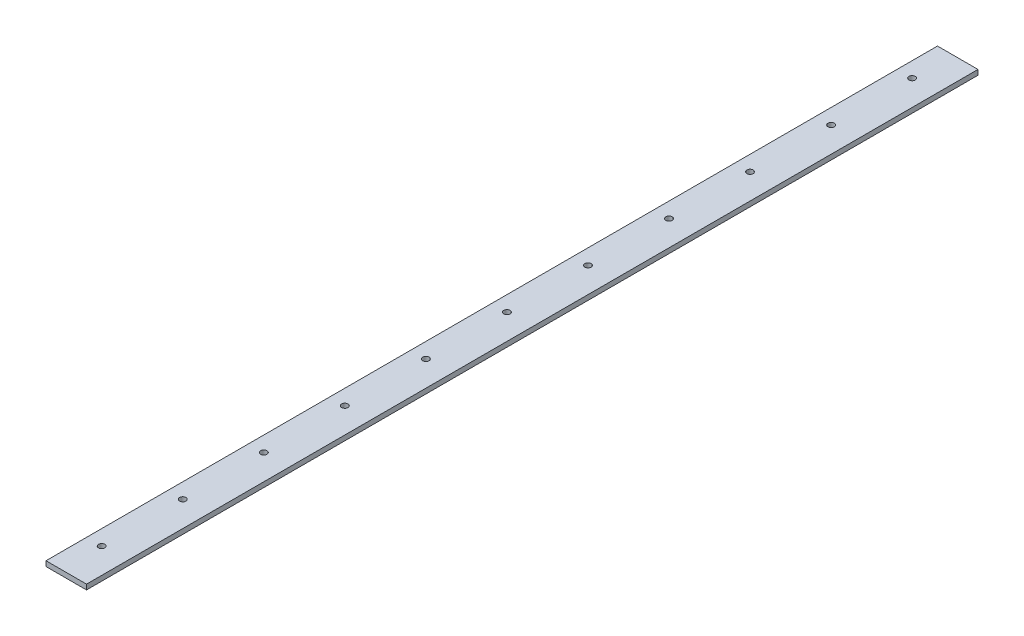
ISO-10303-21;
HEADER;
FILE_DESCRIPTION(('STEP AP214'),'2;1');
FILE_NAME('part.step','',(''),(''),'','','');
FILE_SCHEMA(('AUTOMOTIVE_DESIGN { 1 0 10303 214 1 1 1 1 }'));
ENDSEC;
DATA;
#1=APPLICATION_CONTEXT('core data for automotive mechanical design processes');
#2=APPLICATION_PROTOCOL_DEFINITION('international standard','automotive_design',2000,#1);
#3=PRODUCT_CONTEXT('',#1,'mechanical');
#4=PRODUCT('Part','Part','',(#3));
#5=PRODUCT_RELATED_PRODUCT_CATEGORY('part','',(#4));
#6=PRODUCT_DEFINITION_FORMATION('','',#4);
#7=PRODUCT_DEFINITION_CONTEXT('part definition',#1,'design');
#8=PRODUCT_DEFINITION('design','',#6,#7);
#9=PRODUCT_DEFINITION_SHAPE('','',#8);
#10=(LENGTH_UNIT() NAMED_UNIT(*) SI_UNIT(.MILLI.,.METRE.));
#11=(NAMED_UNIT(*) PLANE_ANGLE_UNIT() SI_UNIT($,.RADIAN.));
#12=(NAMED_UNIT(*) SI_UNIT($,.STERADIAN.) SOLID_ANGLE_UNIT());
#13=UNCERTAINTY_MEASURE_WITH_UNIT(LENGTH_MEASURE(1.E-05),#10,'distance_accuracy_value','');
#14=(GEOMETRIC_REPRESENTATION_CONTEXT(3) GLOBAL_UNCERTAINTY_ASSIGNED_CONTEXT((#13)) GLOBAL_UNIT_ASSIGNED_CONTEXT((#10,
#11,#12)) REPRESENTATION_CONTEXT('',''));
#15=CARTESIAN_POINT('',(0.,0.,0.));
#16=DIRECTION('',(0.,0.,1.));
#17=DIRECTION('',(1.,0.,0.));
#18=AXIS2_PLACEMENT_3D('',#15,#16,#17);
#19=CARTESIAN_POINT('',(-25.4,-3.175,1117.6));
#20=DIRECTION('',(1.,0.,0.));
#21=DIRECTION('',(0.,0.,-1.));
#22=AXIS2_PLACEMENT_3D('',#19,#20,#21);
#23=PLANE('',#22);
#24=DIRECTION('',(0.,-1.,0.));
#25=VECTOR('',#24,1.);
#26=CARTESIAN_POINT('',(-25.4,-3.175,0.));
#27=LINE('',#26,#25);
#28=CARTESIAN_POINT('',(-25.4,3.175,0.));
#29=VERTEX_POINT('',#28);
#30=CARTESIAN_POINT('',(-25.4,-3.175,0.));
#31=VERTEX_POINT('',#30);
#32=EDGE_CURVE('E95',#29,#31,#27,.T.);
#33=ORIENTED_EDGE('',*,*,#32,.T.);
#34=DIRECTION('',(0.,0.,-1.));
#35=VECTOR('',#34,1.);
#36=CARTESIAN_POINT('',(-25.4,-3.175,1117.6));
#37=LINE('',#36,#35);
#38=CARTESIAN_POINT('',(-25.4,-3.175,1117.6));
#39=VERTEX_POINT('',#38);
#40=EDGE_CURVE('E11',#39,#31,#37,.T.);
#41=ORIENTED_EDGE('',*,*,#40,.F.);
#42=DIRECTION('',(0.,-1.,0.));
#43=VECTOR('',#42,1.);
#44=CARTESIAN_POINT('',(-25.4,-3.175,1117.6));
#45=LINE('',#44,#43);
#46=CARTESIAN_POINT('',(-25.4,3.175,1117.6));
#47=VERTEX_POINT('',#46);
#48=EDGE_CURVE('E83',#47,#39,#45,.T.);
#49=ORIENTED_EDGE('',*,*,#48,.F.);
#50=DIRECTION('',(0.,0.,-1.));
#51=VECTOR('',#50,1.);
#52=CARTESIAN_POINT('',(-25.4,3.175,1117.6));
#53=LINE('',#52,#51);
#54=EDGE_CURVE('E91',#47,#29,#53,.T.);
#55=ORIENTED_EDGE('',*,*,#54,.T.);
#56=EDGE_LOOP('',(#33,#41,#49,#55));
#57=FACE_BOUND('',#56,.T.);
#58=ADVANCED_FACE('F32',(#57),#23,.F.);
#59=CARTESIAN_POINT('',(25.4,-3.175,1117.6));
#60=DIRECTION('',(0.,1.,0.));
#61=DIRECTION('',(-1.,0.,0.));
#62=AXIS2_PLACEMENT_3D('',#59,#60,#61);
#63=PLANE('',#62);
#64=CARTESIAN_POINT('',(-6.35000000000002,-3.175,1066.8));
#65=DIRECTION('',(0.,1.,0.));
#66=DIRECTION('',(-1.,0.,0.));
#67=AXIS2_PLACEMENT_3D('',#64,#65,#66);
#68=CIRCLE('',#67,3.9751);
#69=CARTESIAN_POINT('',(-10.3251,-3.175,1066.8));
#70=VERTEX_POINT('',#69);
#71=EDGE_CURVE('E166',#70,#70,#68,.T.);
#72=ORIENTED_EDGE('',*,*,#71,.T.);
#73=EDGE_LOOP('',(#72));
#74=FACE_BOUND('',#73,.T.);
#75=CARTESIAN_POINT('',(-6.35000000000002,-3.175,965.2));
#76=DIRECTION('',(0.,1.,0.));
#77=DIRECTION('',(-1.,0.,0.));
#78=AXIS2_PLACEMENT_3D('',#75,#76,#77);
#79=CIRCLE('',#78,3.9751);
#80=CARTESIAN_POINT('',(-10.3251,-3.175,965.2));
#81=VERTEX_POINT('',#80);
#82=EDGE_CURVE('E160',#81,#81,#79,.T.);
#83=ORIENTED_EDGE('',*,*,#82,.T.);
#84=EDGE_LOOP('',(#83));
#85=FACE_BOUND('',#84,.T.);
#86=CARTESIAN_POINT('',(-6.35000000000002,-3.175,863.6));
#87=DIRECTION('',(0.,1.,0.));
#88=DIRECTION('',(-1.,0.,0.));
#89=AXIS2_PLACEMENT_3D('',#86,#87,#88);
#90=CIRCLE('',#89,3.9751);
#91=CARTESIAN_POINT('',(-10.3251,-3.175,863.6));
#92=VERTEX_POINT('',#91);
#93=EDGE_CURVE('E154',#92,#92,#90,.T.);
#94=ORIENTED_EDGE('',*,*,#93,.T.);
#95=EDGE_LOOP('',(#94));
#96=FACE_BOUND('',#95,.T.);
#97=CARTESIAN_POINT('',(-6.35000000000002,-3.175,762.));
#98=DIRECTION('',(0.,1.,0.));
#99=DIRECTION('',(-1.,0.,0.));
#100=AXIS2_PLACEMENT_3D('',#97,#98,#99);
#101=CIRCLE('',#100,3.9751);
#102=CARTESIAN_POINT('',(-10.3251,-3.175,762.));
#103=VERTEX_POINT('',#102);
#104=EDGE_CURVE('E148',#103,#103,#101,.T.);
#105=ORIENTED_EDGE('',*,*,#104,.T.);
#106=EDGE_LOOP('',(#105));
#107=FACE_BOUND('',#106,.T.);
#108=CARTESIAN_POINT('',(-6.35000000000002,-3.175,457.2));
#109=DIRECTION('',(0.,1.,0.));
#110=DIRECTION('',(-1.,0.,0.));
#111=AXIS2_PLACEMENT_3D('',#108,#109,#110);
#112=CIRCLE('',#111,3.97510000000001);
#113=CARTESIAN_POINT('',(-10.3251,-3.175,457.2));
#114=VERTEX_POINT('',#113);
#115=EDGE_CURVE('E142',#114,#114,#112,.T.);
#116=ORIENTED_EDGE('',*,*,#115,.T.);
#117=EDGE_LOOP('',(#116));
#118=FACE_BOUND('',#117,.T.);
#119=CARTESIAN_POINT('',(-6.35000000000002,-3.175,558.8));
#120=DIRECTION('',(0.,1.,0.));
#121=DIRECTION('',(-1.,0.,0.));
#122=AXIS2_PLACEMENT_3D('',#119,#120,#121);
#123=CIRCLE('',#122,3.9751);
#124=CARTESIAN_POINT('',(-10.3251,-3.175,558.8));
#125=VERTEX_POINT('',#124);
#126=EDGE_CURVE('E136',#125,#125,#123,.T.);
#127=ORIENTED_EDGE('',*,*,#126,.T.);
#128=EDGE_LOOP('',(#127));
#129=FACE_BOUND('',#128,.T.);
#130=CARTESIAN_POINT('',(-6.35000000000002,-3.175,660.4));
#131=DIRECTION('',(0.,1.,0.));
#132=DIRECTION('',(-1.,0.,0.));
#133=AXIS2_PLACEMENT_3D('',#130,#131,#132);
#134=CIRCLE('',#133,3.9751);
#135=CARTESIAN_POINT('',(-10.3251,-3.175,660.4));
#136=VERTEX_POINT('',#135);
#137=EDGE_CURVE('E130',#136,#136,#134,.T.);
#138=ORIENTED_EDGE('',*,*,#137,.T.);
#139=EDGE_LOOP('',(#138));
#140=FACE_BOUND('',#139,.T.);
#141=CARTESIAN_POINT('',(-6.35000000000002,-3.175,254.));
#142=DIRECTION('',(0.,1.,0.));
#143=DIRECTION('',(-1.,0.,0.));
#144=AXIS2_PLACEMENT_3D('',#141,#142,#143);
#145=CIRCLE('',#144,3.9751);
#146=CARTESIAN_POINT('',(-10.3251,-3.175,254.));
#147=VERTEX_POINT('',#146);
#148=EDGE_CURVE('E124',#147,#147,#145,.T.);
#149=ORIENTED_EDGE('',*,*,#148,.T.);
#150=EDGE_LOOP('',(#149));
#151=FACE_BOUND('',#150,.T.);
#152=CARTESIAN_POINT('',(-6.35000000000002,-3.175,355.6));
#153=DIRECTION('',(0.,1.,0.));
#154=DIRECTION('',(-1.,0.,0.));
#155=AXIS2_PLACEMENT_3D('',#152,#153,#154);
#156=CIRCLE('',#155,3.97510000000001);
#157=CARTESIAN_POINT('',(-10.3251,-3.175,355.6));
#158=VERTEX_POINT('',#157);
#159=EDGE_CURVE('E118',#158,#158,#156,.T.);
#160=ORIENTED_EDGE('',*,*,#159,.T.);
#161=EDGE_LOOP('',(#160));
#162=FACE_BOUND('',#161,.T.);
#163=CARTESIAN_POINT('',(-6.35000000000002,-3.175,152.4));
#164=DIRECTION('',(0.,1.,0.));
#165=DIRECTION('',(-1.,0.,0.));
#166=AXIS2_PLACEMENT_3D('',#163,#164,#165);
#167=CIRCLE('',#166,3.9751);
#168=CARTESIAN_POINT('',(-10.3251,-3.175,152.4));
#169=VERTEX_POINT('',#168);
#170=EDGE_CURVE('E112',#169,#169,#167,.T.);
#171=ORIENTED_EDGE('',*,*,#170,.T.);
#172=EDGE_LOOP('',(#171));
#173=FACE_BOUND('',#172,.T.);
#174=CARTESIAN_POINT('',(-6.35000000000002,-3.175,50.8));
#175=DIRECTION('',(0.,1.,0.));
#176=DIRECTION('',(-1.,0.,0.));
#177=AXIS2_PLACEMENT_3D('',#174,#175,#176);
#178=CIRCLE('',#177,3.9751);
#179=CARTESIAN_POINT('',(-10.3251,-3.175,50.8));
#180=VERTEX_POINT('',#179);
#181=EDGE_CURVE('E98',#180,#180,#178,.T.);
#182=ORIENTED_EDGE('',*,*,#181,.T.);
#183=EDGE_LOOP('',(#182));
#184=FACE_BOUND('',#183,.T.);
#185=DIRECTION('',(1.,0.,0.));
#186=VECTOR('',#185,1.);
#187=CARTESIAN_POINT('',(25.4,-3.175,0.));
#188=LINE('',#187,#186);
#189=CARTESIAN_POINT('',(25.4,-3.175,0.));
#190=VERTEX_POINT('',#189);
#191=EDGE_CURVE('E87',#31,#190,#188,.T.);
#192=ORIENTED_EDGE('',*,*,#191,.T.);
#193=DIRECTION('',(0.,0.,-1.));
#194=VECTOR('',#193,1.);
#195=CARTESIAN_POINT('',(25.4,-3.175,1117.6));
#196=LINE('',#195,#194);
#197=CARTESIAN_POINT('',(25.4,-3.175,1117.6));
#198=VERTEX_POINT('',#197);
#199=EDGE_CURVE('E40',#198,#190,#196,.T.);
#200=ORIENTED_EDGE('',*,*,#199,.F.);
#201=DIRECTION('',(1.,0.,0.));
#202=VECTOR('',#201,1.);
#203=CARTESIAN_POINT('',(25.4,-3.175,1117.6));
#204=LINE('',#203,#202);
#205=EDGE_CURVE('E78',#39,#198,#204,.T.);
#206=ORIENTED_EDGE('',*,*,#205,.F.);
#207=ORIENTED_EDGE('',*,*,#40,.T.);
#208=EDGE_LOOP('',(#192,#200,#206,#207));
#209=FACE_BOUND('',#208,.T.);
#210=ADVANCED_FACE('F86',(#74,#85,#96,#107,#118,#129,#140,#151,#162,#173,#184,#209),#63,.F.);
#211=CARTESIAN_POINT('',(25.4,-3.175,1117.6));
#212=DIRECTION('',(-1.,0.,0.));
#213=DIRECTION('',(0.,0.,1.));
#214=AXIS2_PLACEMENT_3D('',#211,#212,#213);
#215=PLANE('',#214);
#216=DIRECTION('',(0.,1.,0.));
#217=VECTOR('',#216,1.);
#218=CARTESIAN_POINT('',(25.4,-3.175,0.));
#219=LINE('',#218,#217);
#220=CARTESIAN_POINT('',(25.4,3.175,0.));
#221=VERTEX_POINT('',#220);
#222=EDGE_CURVE('E65',#190,#221,#219,.T.);
#223=ORIENTED_EDGE('',*,*,#222,.T.);
#224=DIRECTION('',(0.,0.,-1.));
#225=VECTOR('',#224,1.);
#226=CARTESIAN_POINT('',(25.4,3.175,1117.6));
#227=LINE('',#226,#225);
#228=CARTESIAN_POINT('',(25.4,3.175,1117.6));
#229=VERTEX_POINT('',#228);
#230=EDGE_CURVE('E88',#229,#221,#227,.T.);
#231=ORIENTED_EDGE('',*,*,#230,.F.);
#232=DIRECTION('',(0.,1.,0.));
#233=VECTOR('',#232,1.);
#234=CARTESIAN_POINT('',(25.4,-3.175,1117.6));
#235=LINE('',#234,#233);
#236=EDGE_CURVE('E81',#198,#229,#235,.T.);
#237=ORIENTED_EDGE('',*,*,#236,.F.);
#238=ORIENTED_EDGE('',*,*,#199,.T.);
#239=EDGE_LOOP('',(#223,#231,#237,#238));
#240=FACE_BOUND('',#239,.T.);
#241=ADVANCED_FACE('F89',(#240),#215,.F.);
#242=CARTESIAN_POINT('',(25.4,3.175,1117.6));
#243=DIRECTION('',(0.,-1.,0.));
#244=DIRECTION('',(1.,0.,0.));
#245=AXIS2_PLACEMENT_3D('',#242,#243,#244);
#246=PLANE('',#245);
#247=CARTESIAN_POINT('',(-6.35000000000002,3.175,1066.8));
#248=DIRECTION('',(0.,1.,0.));
#249=DIRECTION('',(-1.,0.,0.));
#250=AXIS2_PLACEMENT_3D('',#247,#248,#249);
#251=CIRCLE('',#250,3.9751);
#252=CARTESIAN_POINT('',(-10.3251,3.175,1066.8));
#253=VERTEX_POINT('',#252);
#254=EDGE_CURVE('E169',#253,#253,#251,.T.);
#255=ORIENTED_EDGE('',*,*,#254,.F.);
#256=EDGE_LOOP('',(#255));
#257=FACE_BOUND('',#256,.T.);
#258=CARTESIAN_POINT('',(-6.35000000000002,3.175,965.2));
#259=DIRECTION('',(0.,1.,0.));
#260=DIRECTION('',(-1.,0.,0.));
#261=AXIS2_PLACEMENT_3D('',#258,#259,#260);
#262=CIRCLE('',#261,3.9751);
#263=CARTESIAN_POINT('',(-10.3251,3.175,965.2));
#264=VERTEX_POINT('',#263);
#265=EDGE_CURVE('E163',#264,#264,#262,.T.);
#266=ORIENTED_EDGE('',*,*,#265,.F.);
#267=EDGE_LOOP('',(#266));
#268=FACE_BOUND('',#267,.T.);
#269=CARTESIAN_POINT('',(-6.35000000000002,3.175,863.6));
#270=DIRECTION('',(0.,1.,0.));
#271=DIRECTION('',(-1.,0.,0.));
#272=AXIS2_PLACEMENT_3D('',#269,#270,#271);
#273=CIRCLE('',#272,3.9751);
#274=CARTESIAN_POINT('',(-10.3251,3.175,863.6));
#275=VERTEX_POINT('',#274);
#276=EDGE_CURVE('E157',#275,#275,#273,.T.);
#277=ORIENTED_EDGE('',*,*,#276,.F.);
#278=EDGE_LOOP('',(#277));
#279=FACE_BOUND('',#278,.T.);
#280=CARTESIAN_POINT('',(-6.35000000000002,3.175,762.));
#281=DIRECTION('',(0.,1.,0.));
#282=DIRECTION('',(-1.,0.,0.));
#283=AXIS2_PLACEMENT_3D('',#280,#281,#282);
#284=CIRCLE('',#283,3.9751);
#285=CARTESIAN_POINT('',(-10.3251,3.175,762.));
#286=VERTEX_POINT('',#285);
#287=EDGE_CURVE('E151',#286,#286,#284,.T.);
#288=ORIENTED_EDGE('',*,*,#287,.F.);
#289=EDGE_LOOP('',(#288));
#290=FACE_BOUND('',#289,.T.);
#291=CARTESIAN_POINT('',(-6.35000000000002,3.175,457.2));
#292=DIRECTION('',(0.,1.,0.));
#293=DIRECTION('',(-1.,0.,0.));
#294=AXIS2_PLACEMENT_3D('',#291,#292,#293);
#295=CIRCLE('',#294,3.97510000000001);
#296=CARTESIAN_POINT('',(-10.3251,3.175,457.2));
#297=VERTEX_POINT('',#296);
#298=EDGE_CURVE('E145',#297,#297,#295,.T.);
#299=ORIENTED_EDGE('',*,*,#298,.F.);
#300=EDGE_LOOP('',(#299));
#301=FACE_BOUND('',#300,.T.);
#302=CARTESIAN_POINT('',(-6.35000000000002,3.175,558.8));
#303=DIRECTION('',(0.,1.,0.));
#304=DIRECTION('',(-1.,0.,0.));
#305=AXIS2_PLACEMENT_3D('',#302,#303,#304);
#306=CIRCLE('',#305,3.9751);
#307=CARTESIAN_POINT('',(-10.3251,3.175,558.8));
#308=VERTEX_POINT('',#307);
#309=EDGE_CURVE('E139',#308,#308,#306,.T.);
#310=ORIENTED_EDGE('',*,*,#309,.F.);
#311=EDGE_LOOP('',(#310));
#312=FACE_BOUND('',#311,.T.);
#313=CARTESIAN_POINT('',(-6.35000000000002,3.175,660.4));
#314=DIRECTION('',(0.,1.,0.));
#315=DIRECTION('',(-1.,0.,0.));
#316=AXIS2_PLACEMENT_3D('',#313,#314,#315);
#317=CIRCLE('',#316,3.9751);
#318=CARTESIAN_POINT('',(-10.3251,3.175,660.4));
#319=VERTEX_POINT('',#318);
#320=EDGE_CURVE('E133',#319,#319,#317,.T.);
#321=ORIENTED_EDGE('',*,*,#320,.F.);
#322=EDGE_LOOP('',(#321));
#323=FACE_BOUND('',#322,.T.);
#324=CARTESIAN_POINT('',(-6.35000000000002,3.175,254.));
#325=DIRECTION('',(0.,1.,0.));
#326=DIRECTION('',(-1.,0.,0.));
#327=AXIS2_PLACEMENT_3D('',#324,#325,#326);
#328=CIRCLE('',#327,3.9751);
#329=CARTESIAN_POINT('',(-10.3251,3.175,254.));
#330=VERTEX_POINT('',#329);
#331=EDGE_CURVE('E127',#330,#330,#328,.T.);
#332=ORIENTED_EDGE('',*,*,#331,.F.);
#333=EDGE_LOOP('',(#332));
#334=FACE_BOUND('',#333,.T.);
#335=CARTESIAN_POINT('',(-6.35000000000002,3.175,355.6));
#336=DIRECTION('',(0.,1.,0.));
#337=DIRECTION('',(-1.,0.,0.));
#338=AXIS2_PLACEMENT_3D('',#335,#336,#337);
#339=CIRCLE('',#338,3.97510000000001);
#340=CARTESIAN_POINT('',(-10.3251,3.175,355.6));
#341=VERTEX_POINT('',#340);
#342=EDGE_CURVE('E121',#341,#341,#339,.T.);
#343=ORIENTED_EDGE('',*,*,#342,.F.);
#344=EDGE_LOOP('',(#343));
#345=FACE_BOUND('',#344,.T.);
#346=CARTESIAN_POINT('',(-6.35000000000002,3.175,152.4));
#347=DIRECTION('',(0.,1.,0.));
#348=DIRECTION('',(-1.,0.,0.));
#349=AXIS2_PLACEMENT_3D('',#346,#347,#348);
#350=CIRCLE('',#349,3.9751);
#351=CARTESIAN_POINT('',(-10.3251,3.175,152.4));
#352=VERTEX_POINT('',#351);
#353=EDGE_CURVE('E115',#352,#352,#350,.T.);
#354=ORIENTED_EDGE('',*,*,#353,.F.);
#355=EDGE_LOOP('',(#354));
#356=FACE_BOUND('',#355,.T.);
#357=CARTESIAN_POINT('',(-6.35000000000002,3.175,50.8));
#358=DIRECTION('',(0.,1.,0.));
#359=DIRECTION('',(-1.,0.,0.));
#360=AXIS2_PLACEMENT_3D('',#357,#358,#359);
#361=CIRCLE('',#360,3.9751);
#362=CARTESIAN_POINT('',(-10.3251,3.175,50.8));
#363=VERTEX_POINT('',#362);
#364=EDGE_CURVE('E109',#363,#363,#361,.T.);
#365=ORIENTED_EDGE('',*,*,#364,.F.);
#366=EDGE_LOOP('',(#365));
#367=FACE_BOUND('',#366,.T.);
#368=DIRECTION('',(-1.,0.,0.));
#369=VECTOR('',#368,1.);
#370=CARTESIAN_POINT('',(25.4,3.175,0.));
#371=LINE('',#370,#369);
#372=EDGE_CURVE('E71',#221,#29,#371,.T.);
#373=ORIENTED_EDGE('',*,*,#372,.T.);
#374=ORIENTED_EDGE('',*,*,#54,.F.);
#375=DIRECTION('',(-1.,0.,0.));
#376=VECTOR('',#375,1.);
#377=CARTESIAN_POINT('',(25.4,3.175,1117.6));
#378=LINE('',#377,#376);
#379=EDGE_CURVE('E48',#229,#47,#378,.T.);
#380=ORIENTED_EDGE('',*,*,#379,.F.);
#381=ORIENTED_EDGE('',*,*,#230,.T.);
#382=EDGE_LOOP('',(#373,#374,#380,#381));
#383=FACE_BOUND('',#382,.T.);
#384=ADVANCED_FACE('F103',(#257,#268,#279,#290,#301,#312,#323,#334,#345,#356,#367,#383),#246,.F.);
#385=CARTESIAN_POINT('',(-25.4,3.175,1117.6));
#386=DIRECTION('',(0.,0.,1.));
#387=DIRECTION('',(1.,0.,0.));
#388=AXIS2_PLACEMENT_3D('',#385,#386,#387);
#389=PLANE('',#388);
#390=ORIENTED_EDGE('',*,*,#48,.T.);
#391=ORIENTED_EDGE('',*,*,#205,.T.);
#392=ORIENTED_EDGE('',*,*,#236,.T.);
#393=ORIENTED_EDGE('',*,*,#379,.T.);
#394=EDGE_LOOP('',(#390,#391,#392,#393));
#395=FACE_BOUND('',#394,.T.);
#396=ADVANCED_FACE('F79',(#395),#389,.T.);
#397=CARTESIAN_POINT('',(-25.4,3.175,0.));
#398=DIRECTION('',(0.,0.,1.));
#399=DIRECTION('',(1.,0.,0.));
#400=AXIS2_PLACEMENT_3D('',#397,#398,#399);
#401=PLANE('',#400);
#402=ORIENTED_EDGE('',*,*,#32,.F.);
#403=ORIENTED_EDGE('',*,*,#372,.F.);
#404=ORIENTED_EDGE('',*,*,#222,.F.);
#405=ORIENTED_EDGE('',*,*,#191,.F.);
#406=EDGE_LOOP('',(#402,#403,#404,#405));
#407=FACE_BOUND('',#406,.T.);
#408=ADVANCED_FACE('F106',(#407),#401,.F.);
#409=CARTESIAN_POINT('',(-6.35000000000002,-3.175,50.8));
#410=DIRECTION('',(0.,1.,0.));
#411=DIRECTION('',(-1.,0.,0.));
#412=AXIS2_PLACEMENT_3D('',#409,#410,#411);
#413=CYLINDRICAL_SURFACE('',#412,3.9751);
#414=ORIENTED_EDGE('',*,*,#181,.F.);
#415=EDGE_LOOP('',(#414));
#416=FACE_BOUND('',#415,.T.);
#417=ORIENTED_EDGE('',*,*,#364,.T.);
#418=EDGE_LOOP('',(#417));
#419=FACE_BOUND('',#418,.T.);
#420=ADVANCED_FACE('F207',(#416,#419),#413,.F.);
#421=CARTESIAN_POINT('',(-6.35000000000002,-3.175,152.4));
#422=DIRECTION('',(0.,1.,0.));
#423=DIRECTION('',(-1.,0.,0.));
#424=AXIS2_PLACEMENT_3D('',#421,#422,#423);
#425=CYLINDRICAL_SURFACE('',#424,3.9751);
#426=ORIENTED_EDGE('',*,*,#170,.F.);
#427=EDGE_LOOP('',(#426));
#428=FACE_BOUND('',#427,.T.);
#429=ORIENTED_EDGE('',*,*,#353,.T.);
#430=EDGE_LOOP('',(#429));
#431=FACE_BOUND('',#430,.T.);
#432=ADVANCED_FACE('F209',(#428,#431),#425,.F.);
#433=CARTESIAN_POINT('',(-6.35000000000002,-3.175,355.6));
#434=DIRECTION('',(0.,1.,0.));
#435=DIRECTION('',(-1.,0.,0.));
#436=AXIS2_PLACEMENT_3D('',#433,#434,#435);
#437=CYLINDRICAL_SURFACE('',#436,3.97510000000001);
#438=ORIENTED_EDGE('',*,*,#159,.F.);
#439=EDGE_LOOP('',(#438));
#440=FACE_BOUND('',#439,.T.);
#441=ORIENTED_EDGE('',*,*,#342,.T.);
#442=EDGE_LOOP('',(#441));
#443=FACE_BOUND('',#442,.T.);
#444=ADVANCED_FACE('F216',(#440,#443),#437,.F.);
#445=CARTESIAN_POINT('',(-6.35000000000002,-3.175,254.));
#446=DIRECTION('',(0.,1.,0.));
#447=DIRECTION('',(-1.,0.,0.));
#448=AXIS2_PLACEMENT_3D('',#445,#446,#447);
#449=CYLINDRICAL_SURFACE('',#448,3.9751);
#450=ORIENTED_EDGE('',*,*,#148,.F.);
#451=EDGE_LOOP('',(#450));
#452=FACE_BOUND('',#451,.T.);
#453=ORIENTED_EDGE('',*,*,#331,.T.);
#454=EDGE_LOOP('',(#453));
#455=FACE_BOUND('',#454,.T.);
#456=ADVANCED_FACE('F269',(#452,#455),#449,.F.);
#457=CARTESIAN_POINT('',(-6.35000000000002,-3.175,660.4));
#458=DIRECTION('',(0.,1.,0.));
#459=DIRECTION('',(-1.,0.,0.));
#460=AXIS2_PLACEMENT_3D('',#457,#458,#459);
#461=CYLINDRICAL_SURFACE('',#460,3.9751);
#462=ORIENTED_EDGE('',*,*,#137,.F.);
#463=EDGE_LOOP('',(#462));
#464=FACE_BOUND('',#463,.T.);
#465=ORIENTED_EDGE('',*,*,#320,.T.);
#466=EDGE_LOOP('',(#465));
#467=FACE_BOUND('',#466,.T.);
#468=ADVANCED_FACE('F279',(#464,#467),#461,.F.);
#469=CARTESIAN_POINT('',(-6.35000000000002,-3.175,558.8));
#470=DIRECTION('',(0.,1.,0.));
#471=DIRECTION('',(-1.,0.,0.));
#472=AXIS2_PLACEMENT_3D('',#469,#470,#471);
#473=CYLINDRICAL_SURFACE('',#472,3.9751);
#474=ORIENTED_EDGE('',*,*,#126,.F.);
#475=EDGE_LOOP('',(#474));
#476=FACE_BOUND('',#475,.T.);
#477=ORIENTED_EDGE('',*,*,#309,.T.);
#478=EDGE_LOOP('',(#477));
#479=FACE_BOUND('',#478,.T.);
#480=ADVANCED_FACE('F289',(#476,#479),#473,.F.);
#481=CARTESIAN_POINT('',(-6.35000000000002,-3.175,457.2));
#482=DIRECTION('',(0.,1.,0.));
#483=DIRECTION('',(-1.,0.,0.));
#484=AXIS2_PLACEMENT_3D('',#481,#482,#483);
#485=CYLINDRICAL_SURFACE('',#484,3.97510000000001);
#486=ORIENTED_EDGE('',*,*,#115,.F.);
#487=EDGE_LOOP('',(#486));
#488=FACE_BOUND('',#487,.T.);
#489=ORIENTED_EDGE('',*,*,#298,.T.);
#490=EDGE_LOOP('',(#489));
#491=FACE_BOUND('',#490,.T.);
#492=ADVANCED_FACE('F299',(#488,#491),#485,.F.);
#493=CARTESIAN_POINT('',(-6.35000000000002,-3.175,762.));
#494=DIRECTION('',(0.,1.,0.));
#495=DIRECTION('',(-1.,0.,0.));
#496=AXIS2_PLACEMENT_3D('',#493,#494,#495);
#497=CYLINDRICAL_SURFACE('',#496,3.9751);
#498=ORIENTED_EDGE('',*,*,#104,.F.);
#499=EDGE_LOOP('',(#498));
#500=FACE_BOUND('',#499,.T.);
#501=ORIENTED_EDGE('',*,*,#287,.T.);
#502=EDGE_LOOP('',(#501));
#503=FACE_BOUND('',#502,.T.);
#504=ADVANCED_FACE('F309',(#500,#503),#497,.F.);
#505=CARTESIAN_POINT('',(-6.35000000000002,-3.175,863.6));
#506=DIRECTION('',(0.,1.,0.));
#507=DIRECTION('',(-1.,0.,0.));
#508=AXIS2_PLACEMENT_3D('',#505,#506,#507);
#509=CYLINDRICAL_SURFACE('',#508,3.9751);
#510=ORIENTED_EDGE('',*,*,#93,.F.);
#511=EDGE_LOOP('',(#510));
#512=FACE_BOUND('',#511,.T.);
#513=ORIENTED_EDGE('',*,*,#276,.T.);
#514=EDGE_LOOP('',(#513));
#515=FACE_BOUND('',#514,.T.);
#516=ADVANCED_FACE('F319',(#512,#515),#509,.F.);
#517=CARTESIAN_POINT('',(-6.35000000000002,-3.175,965.2));
#518=DIRECTION('',(0.,1.,0.));
#519=DIRECTION('',(-1.,0.,0.));
#520=AXIS2_PLACEMENT_3D('',#517,#518,#519);
#521=CYLINDRICAL_SURFACE('',#520,3.9751);
#522=ORIENTED_EDGE('',*,*,#82,.F.);
#523=EDGE_LOOP('',(#522));
#524=FACE_BOUND('',#523,.T.);
#525=ORIENTED_EDGE('',*,*,#265,.T.);
#526=EDGE_LOOP('',(#525));
#527=FACE_BOUND('',#526,.T.);
#528=ADVANCED_FACE('F180',(#524,#527),#521,.F.);
#529=CARTESIAN_POINT('',(-6.35000000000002,-3.175,1066.8));
#530=DIRECTION('',(0.,1.,0.));
#531=DIRECTION('',(-1.,0.,0.));
#532=AXIS2_PLACEMENT_3D('',#529,#530,#531);
#533=CYLINDRICAL_SURFACE('',#532,3.9751);
#534=ORIENTED_EDGE('',*,*,#71,.F.);
#535=EDGE_LOOP('',(#534));
#536=FACE_BOUND('',#535,.T.);
#537=ORIENTED_EDGE('',*,*,#254,.T.);
#538=EDGE_LOOP('',(#537));
#539=FACE_BOUND('',#538,.T.);
#540=ADVANCED_FACE('F177',(#536,#539),#533,.F.);
#541=CLOSED_SHELL('',(#58,#210,#241,#384,#396,#408,#420,#432,#444,#456,#468,#480,#492,#504,#516,
#528,#540));
#542=MANIFOLD_SOLID_BREP('B2',#541);
#543=ADVANCED_BREP_SHAPE_REPRESENTATION('',(#18,#542),#14);
#544=SHAPE_DEFINITION_REPRESENTATION(#9,#543);
ENDSEC;
END-ISO-10303-21;
